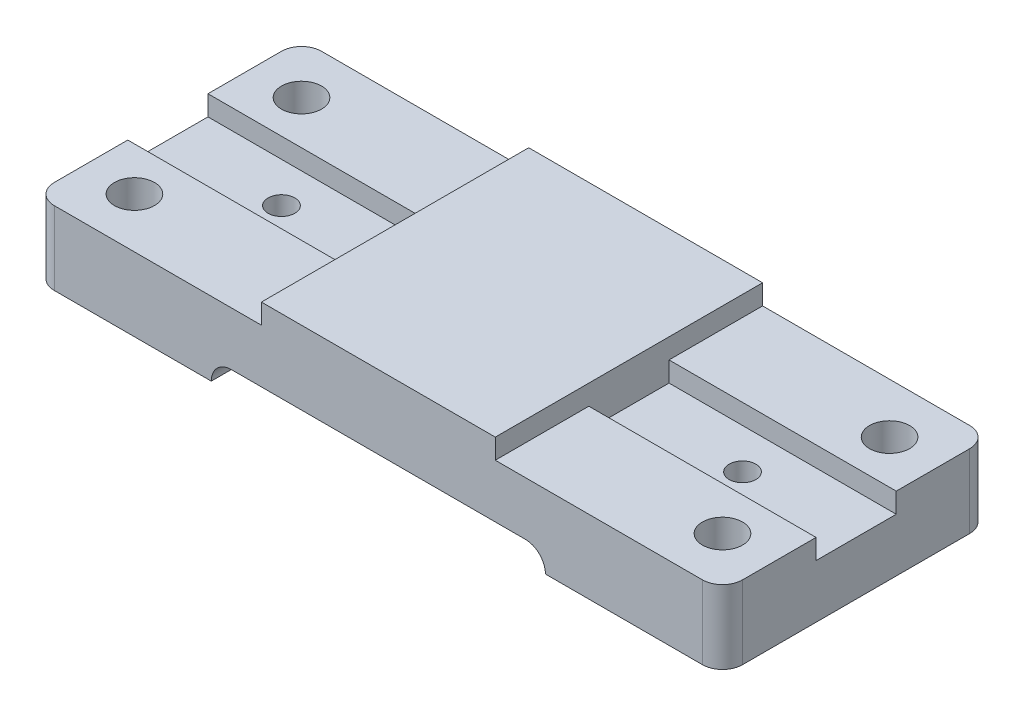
from build123d import *

# Parameters (mm, degrees)
SKETCH1_R          = 6
EXTRUDE1_DEPTH     = 22
CUT_EXTRUDE1_DEPTH = 223.08106628
SKETCH3_W          = 68
SKETCH3_H          = 24
CUT_EXTRUDE2_DEPTH = 6
SKETCH4_W          = 70
SKETCH4_H          = 80
EXTRUDE2_DEPTH     = 6
SKETCH5_R          = 7
CUT_EXTRUDE3_DEPTH = 10
SKETCH6_R          = 4
CUT_EXTRUDE4_DEPTH = 6


with BuildPart() as part:
    # Sketch1 → Extrude1 (new body)
    with BuildSketch(Plane(origin=(0, 0, 0), x_dir=(1, 0, 0), z_dir=(0, 1, 0))):
        with BuildLine():
            Line((6, 0), (200, 0))
            ThreePointArc((200, 0), (204.242640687, 1.757359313), (206, 6))
            Line((206, 6), (206, 74))
            ThreePointArc((206, 74), (204.242640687, 78.242640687), (200, 80))
            Line((200, 80), (6, 80))
            ThreePointArc((6, 80), (1.757359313, 78.242640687), (0, 74))
            Line((0, 74), (0, 6))
            ThreePointArc((0, 6), (1.757359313, 1.757359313), (6, 0))
        make_face()
        with Locations(Location((15, 65, 0), (0, 0, 270))):
            Circle(SKETCH1_R, mode=Mode.SUBTRACT)
        with Locations(Location((191, 65, 0), (0, 0, 270))):
            Circle(SKETCH1_R, mode=Mode.SUBTRACT)
        with Locations(Location((15, 15, 0), (0, 0, 270))):
            Circle(SKETCH1_R, mode=Mode.SUBTRACT)
        with Locations(Location((191, 15, 0), (0, 0, 270))):
            Circle(SKETCH1_R, mode=Mode.SUBTRACT)
    extrude(amount=EXTRUDE1_DEPTH)

    # Sketch2 → Cut-Extrude1 (cut, through all)
    with BuildSketch(Plane.XY):
        with BuildLine():
            Line((53, 0), (153, 0))
            ThreePointArc((153, 0), (151.242640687, 4.242640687), (147, 6))
            Line((147, 6), (59, 6))
            ThreePointArc((59, 6), (54.757359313, 4.242640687), (53, 0))
        make_face()
    extrude(amount=-CUT_EXTRUDE1_DEPTH, mode=Mode.SUBTRACT)

    # Sketch3 → Cut-Extrude2 (cut)
    with BuildSketch(Plane(origin=(0, 22, 0), x_dir=(-1, 0, 0), z_dir=(0, 1, 0))):
        with Locations((-34, -40)):
            Rectangle(SKETCH3_W, SKETCH3_H)
        with Locations((-172, -40)):
            Rectangle(SKETCH3_W, SKETCH3_H)
    extrude(amount=-CUT_EXTRUDE2_DEPTH, mode=Mode.SUBTRACT)

    # Sketch4 → Extrude2 (add)
    with BuildSketch(Plane(origin=(0, 22, 0), x_dir=(-1, 0, 0), z_dir=(0, 1, 0))):
        with Locations((-103, -40)):
            Rectangle(SKETCH4_W, SKETCH4_H)
    extrude(amount=EXTRUDE2_DEPTH)

    # Sketch5 → Cut-Extrude3 (cut)
    with BuildSketch(Plane.XZ):
        with Locations(Location((34, -40, 0), (0, 0, 270))):
            Circle(SKETCH5_R)
        with Locations(Location((172, -40, 0), (0, 0, 270))):
            Circle(SKETCH5_R)
    extrude(amount=-CUT_EXTRUDE3_DEPTH, mode=Mode.SUBTRACT)

    # Sketch6 → Cut-Extrude4 (cut)
    with BuildSketch(Plane.XZ.offset(-10)):
        with Locations(Location((34, -40, 0), (0, 0, 270))):
            Circle(SKETCH6_R)
        with Locations(Location((172, -40, 0), (0, 0, 270))):
            Circle(SKETCH6_R)
    extrude(amount=-CUT_EXTRUDE4_DEPTH, mode=Mode.SUBTRACT)


solid = part.part
